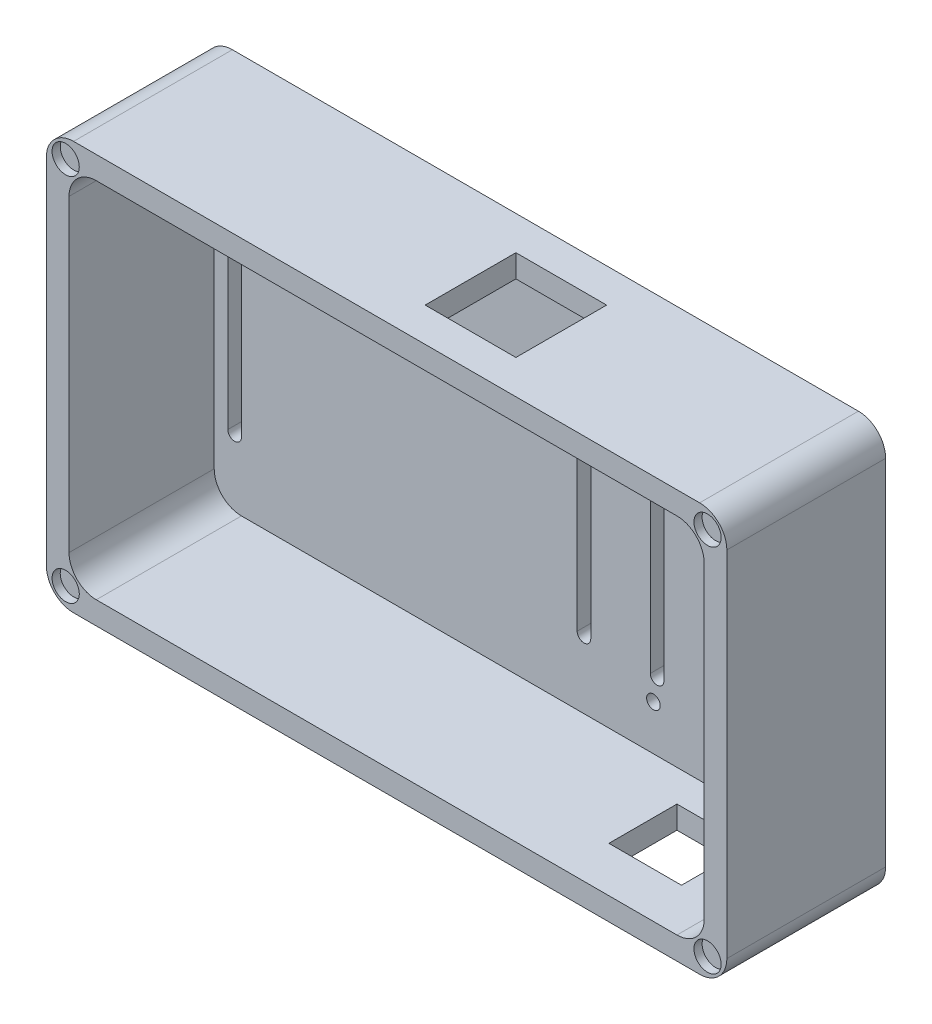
from build123d import *

# Parameters (mm, degrees)
BOSS_EXTRU_2_DEPTH           = 35
ENL_V_MAT_EXTRU_1_DEPTH      = 32
ESQUISSE3_R                  = 3
ENL_V_MAT_EXTRU_2_DEPTH      = 1.8
ENL_V_MAT_EXTRU_3_DEPTH      = 94.134311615
ENL_V_MAT_EXTRU_3_DEPTH_BACK = 94.134311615
ESQUISSE4_R                  = 1.5
ESQUISSE5_W                  = 20
ESQUISSE5_H                  = 20
ENL_V_MAT_EXTRU_4_DEPTH      = 5
ESQUISSE7_W                  = 16
ESQUISSE7_H                  = 15
ENL_V_MAT_EXTRU_5_DEPTH      = 10


with BuildPart() as part:
    # Esquisse1 → Boss.-Extru.2 (new body)
    with BuildSketch(Plane.XY):
        with BuildLine():
            Line((-69, -45), (69, -45))
            ThreePointArc((69, -45), (73.242640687, -43.242640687), (75, -39))
            Line((75, -39), (75, 39))
            ThreePointArc((75, 39), (73.242640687, 43.242640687), (69, 45))
            Line((69, 45), (-69, 45))
            ThreePointArc((-69, 45), (-73.242640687, 43.242640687), (-75, 39))
            Line((-75, 39), (-75, -39))
            ThreePointArc((-75, -39), (-73.242640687, -43.242640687), (-69, -45))
        make_face()
    extrude(amount=-BOSS_EXTRU_2_DEPTH)

    # Esquisse2 → Enl_v. mat.-Extru.1 (cut)
    with BuildSketch(Plane.XY):
        with BuildLine():
            Line((64, -40), (-64, -40))
            ThreePointArc((-64, -40), (-68.242640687, -38.242640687), (-70, -34))
            Line((-70, -34), (-70, 34))
            ThreePointArc((-70, 34), (-68.242640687, 38.242640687), (-64, 40))
            Line((-64, 40), (64, 40))
            ThreePointArc((64, 40), (68.242640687, 38.242640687), (70, 34))
            Line((70, 34), (70, -34))
            ThreePointArc((70, -34), (68.242640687, -38.242640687), (64, -40))
        make_face()
    extrude(amount=-ENL_V_MAT_EXTRU_1_DEPTH, mode=Mode.SUBTRACT)

    # Esquisse3 → Enl_v. mat.-Extru.2 (cut)
    with BuildSketch(Plane.XY):
        with Locations((-70.742640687, 40.742640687)):
            Circle(ESQUISSE3_R)
        with Locations(Location((70.742640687, 40.742640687, 0), (0, 0, 180))):
            Circle(ESQUISSE3_R)
        with Locations((70.742640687, -40.742640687)):
            Circle(ESQUISSE3_R)
        with Locations(Location((-70.742640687, -40.742640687, 0), (0, 0, 180))):
            Circle(ESQUISSE3_R)
    extrude(amount=-ENL_V_MAT_EXTRU_2_DEPTH, mode=Mode.SUBTRACT)

    # Esquisse4 → Enl_v. mat.-Extru.3 (cut, two sides: drawn at the far end of the back side and taken through both)
    with BuildSketch(Plane.XY.offset(-32).offset(-ENL_V_MAT_EXTRU_3_DEPTH_BACK)):
        with Locations((60.72, 32.25)):
            Circle(ESQUISSE4_R)
        with Locations((26.81, -30.09)):
            Circle(ESQUISSE4_R)
        with BuildLine():
            Line((-67, 25), (-67, -25))
            ThreePointArc((-67, -25), (-65.5, -26.5), (-64, -25))
            Line((-64, -25), (-64, 25))
            ThreePointArc((-64, 25), (-65.5, 26.5), (-67, 25))
        make_face()
        with BuildLine():
            Line((64, 25), (64, -25))
            ThreePointArc((64, -25), (65.5, -26.5), (67, -25))
            Line((67, -25), (67, 25))
            ThreePointArc((67, 25), (65.5, 26.5), (64, 25))
        make_face()
        with BuildLine():
            Line((10, 25), (10, -25))
            ThreePointArc((10, -25), (11.5, -26.5), (13, -25))
            Line((13, -25), (13, 25))
            ThreePointArc((13, 25), (11.5, 26.5), (10, 25))
        make_face()
        with BuildLine():
            Line((26.12, 25), (26.12, -25))
            ThreePointArc((26.12, -25), (27.62, -26.5), (29.12, -25))
            Line((29.12, -25), (29.12, 25))
            ThreePointArc((29.12, 25), (27.62, 26.5), (26.12, 25))
        make_face()
    extrude(amount=ENL_V_MAT_EXTRU_3_DEPTH + ENL_V_MAT_EXTRU_3_DEPTH_BACK, mode=Mode.SUBTRACT)

    # Esquisse5 → Enl_v. mat.-Extru.4 (cut)
    with BuildSketch(Plane(origin=(0, 45, 0), x_dir=(1, 0, 0), z_dir=(0, 1, 0))):
        with Locations((11, 17.5)):
            Rectangle(ESQUISSE5_W, ESQUISSE5_H)
    extrude(amount=-ENL_V_MAT_EXTRU_4_DEPTH, mode=Mode.SUBTRACT)

    # Esquisse7 → Enl_v. mat.-Extru.5 (cut)
    with BuildSketch(Plane(origin=(0, -45, 0), x_dir=(-1, 0, 0), z_dir=(0, -1, 0))):
        with Locations((-47, 17.5)):
            Rectangle(ESQUISSE7_W, ESQUISSE7_H)
    extrude(amount=-ENL_V_MAT_EXTRU_5_DEPTH, mode=Mode.SUBTRACT)


solid = part.part
